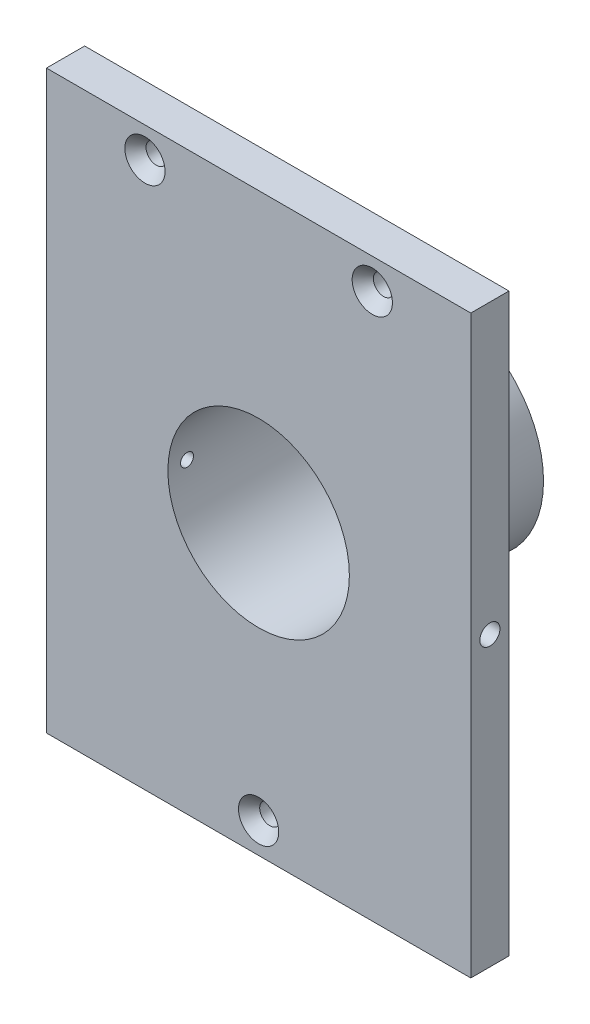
from build123d import *

# Parameters (mm, degrees)
SKETCH1_W                                      = 88.9
SKETCH1_H                                      = 120.65
BOSS_EXTRUDE1_DEPTH                            = 8.001
SKETCH2_R                                      = 22.225
BOSS_EXTRUDE2_DEPTH                            = 29.464
SKETCH3_R                                      = 19.0119
CUT_EXTRUDE1_DEPTH                             = 84.776693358
CSK_FOR_8_FLAT_HEAD_MACHINE_SCREW1_D           = 4.3053
CSK_FOR_8_FLAT_HEAD_MACHINE_SCREW1_CSINK_D     = 8.4328
CSK_FOR_8_FLAT_HEAD_MACHINE_SCREW1_CSINK_ANGLE = 82
SKETCH6_R                                      = 2.1082
CUT_EXTRUDE2_DEPTH                             = 19.05
F_6_32_TAPPED_HOLE1_REACH                      = 98.883
F_6_32_TAPPED_HOLE1_BORE_R                     = 1.35255


with BuildPart() as part:
    # Sketch1 → Boss-Extrude1 (new body)
    with BuildSketch(Plane.XY):
        Rectangle(SKETCH1_W, SKETCH1_H)
    extrude(amount=BOSS_EXTRUDE1_DEPTH)

    # Sketch2 → Boss-Extrude2 (add)
    with BuildSketch(Plane(origin=(0, 0, 0), x_dir=(-1, 0, 0), z_dir=(0, 0, -1))):
        with Locations(Location((0, 0, 0), (0, 0, 180))):
            Circle(SKETCH2_R)
    extrude(amount=BOSS_EXTRUDE2_DEPTH)

    # Sketch3 → Cut-Extrude1 (cut, through all)
    with BuildSketch(Plane.XY.offset(8.001)):
        Circle(SKETCH3_R)
    extrude(amount=-CUT_EXTRUDE1_DEPTH, mode=Mode.SUBTRACT)

    # CSK for _8 Flat Head Machine Screw1 (through all)
    with Locations(Plane.XY.offset(8.001)):
        with Locations((-23.8125, 53.975), (23.8125, 53.975), (0, -53.975)):
            CounterSinkHole(CSK_FOR_8_FLAT_HEAD_MACHINE_SCREW1_D / 2, CSK_FOR_8_FLAT_HEAD_MACHINE_SCREW1_CSINK_D / 2, counter_sink_angle=CSK_FOR_8_FLAT_HEAD_MACHINE_SCREW1_CSINK_ANGLE)

    # Sketch6 → Cut-Extrude2 (cut)
    with BuildSketch(Plane(origin=(44.45, 0, 0), x_dir=(0, 0, -1), z_dir=(1, 0, 0))):
        with Locations(Location((-4.0005, 0, 0), (0, 0, 90))):
            Circle(SKETCH6_R)
    cut_extrude2 = extrude(amount=-CUT_EXTRUDE2_DEPTH, mode=Mode.SUBTRACT)

    # 6-32 Tapped Hole1 bore → 6-32 Tapped Hole1 (cut, up to next)
    with BuildSketch(Plane(origin=(25.4, 0, 0), x_dir=(0, 0, -1), z_dir=(1, 0, 0)), mode=Mode.PRIVATE) as f_6_32_tapped_hole1_sk1:
        with Locations((-4.0005, 0)):
            Circle(F_6_32_TAPPED_HOLE1_BORE_R)
    f_6_32_tapped_hole1_tool1 = extrude(f_6_32_tapped_hole1_sk1.sketch, amount=-F_6_32_TAPPED_HOLE1_REACH, mode=Mode.PRIVATE) & part.part
    f_6_32_tapped_hole1 = f_6_32_tapped_hole1_tool1.solids().sort_by_distance((25.4, 0, 4.0005))[0]
    add(f_6_32_tapped_hole1, mode=Mode.SUBTRACT)

    # Mirror1: Cut-Extrude2, 6-32 Tapped Hole1 across plane
    add(cut_extrude2.mirror(Plane(origin=(0, 0, 0), x_dir=(0, 0, 1), z_dir=(1, 0, 0))), mode=Mode.SUBTRACT)
    add(f_6_32_tapped_hole1.mirror(Plane(origin=(0, 0, 0), x_dir=(0, 0, 1), z_dir=(1, 0, 0))), mode=Mode.SUBTRACT)


solid = part.part
